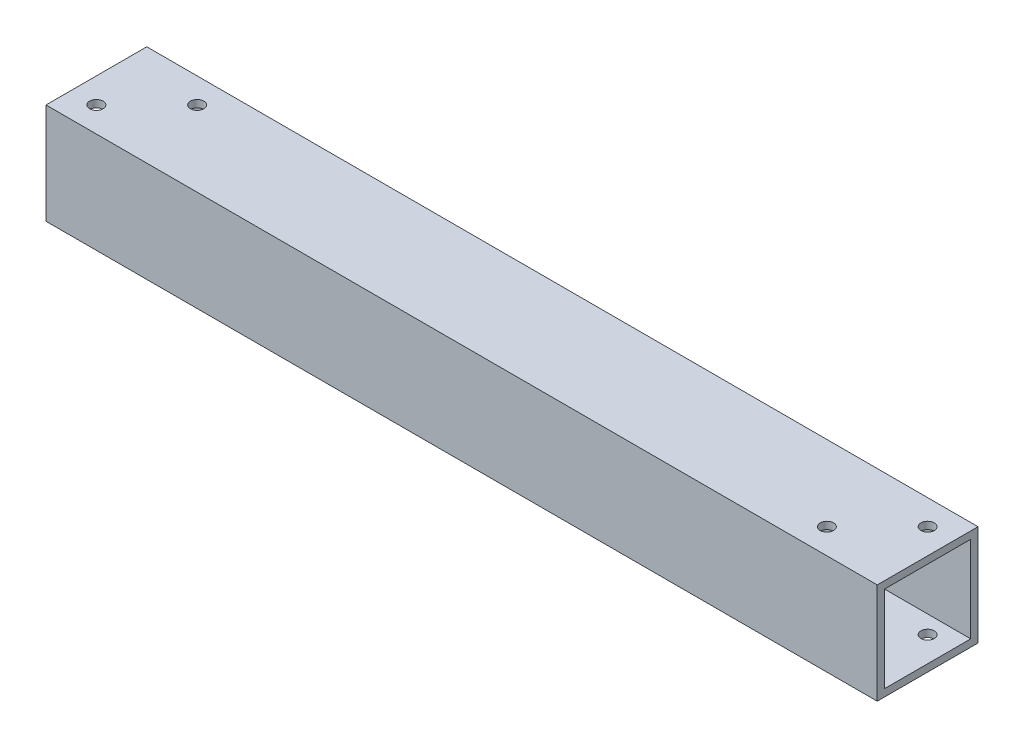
from build123d import *

# Parameters (mm, degrees)
SKETCH1_W          = 50.8
SKETCH1_H          = 50.8
SKETCH1_W_2        = 43.4848
SKETCH1_H_2        = 43.4848
EXTRUDE1_DEPTH     = 419.1
SKETCH3_R          = 3.37312
CUT_EXTRUDE1_DEPTH = 426.212993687


with BuildPart() as part:
    # Sketch1 → Extrude1 (new body)
    with BuildSketch(Plane(origin=(0, 0, 0), x_dir=(0, 0, -1), z_dir=(1, 0, 0))):
        with Locations((25.4, 25.4)):
            Rectangle(SKETCH1_W, SKETCH1_H)
        with Locations((25.4, 25.4)):
            Rectangle(SKETCH1_W_2, SKETCH1_H_2, mode=Mode.SUBTRACT)
    extrude(amount=EXTRUDE1_DEPTH)

    # Sketch3 → Cut-Extrude1 (cut, through all)
    with BuildSketch(Plane(origin=(0, 50.8, 0), x_dir=(1, 0, 0), z_dir=(0, 1, 0))):
        with Locations(Location((12.7, 12.7, 0), (0, 0, 270))):
            Circle(SKETCH3_R)
        with Locations(Location((38.1, 38.1, 0), (0, 0, 270))):
            Circle(SKETCH3_R)
        with Locations(Location((406.4, 38.1, 0), (0, 0, 270))):
            Circle(SKETCH3_R)
        with Locations(Location((381, 12.7, 0), (0, 0, 270))):
            Circle(SKETCH3_R)
    extrude(amount=-CUT_EXTRUDE1_DEPTH, mode=Mode.SUBTRACT)


solid = part.part
